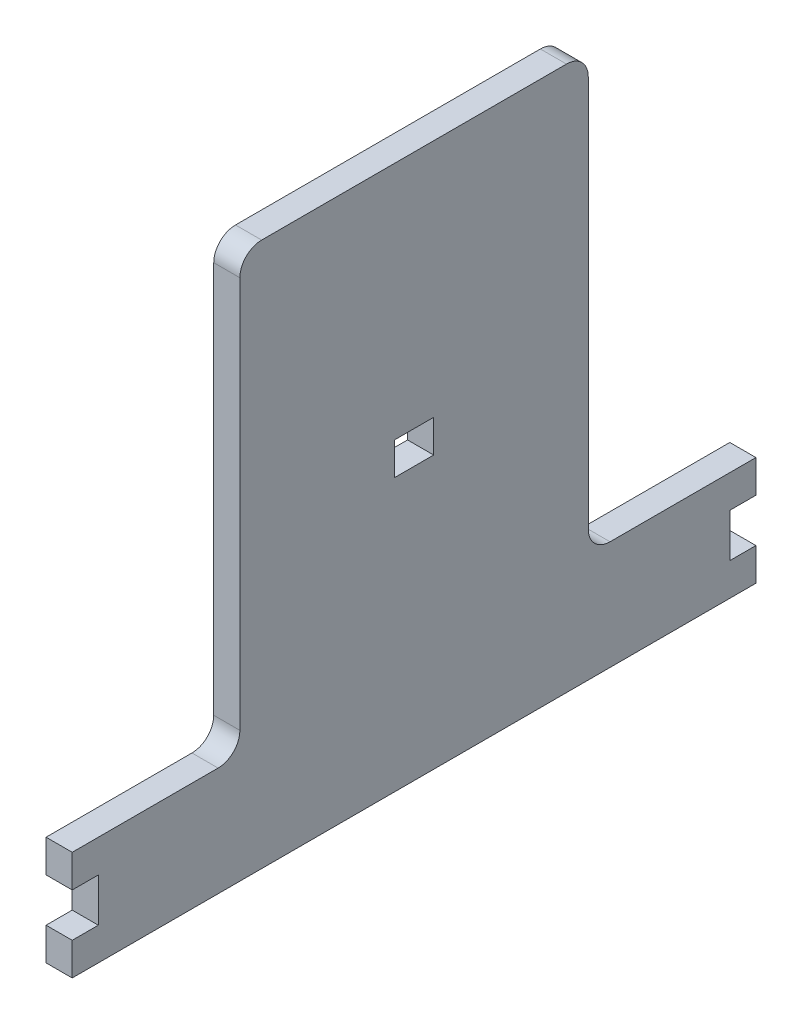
ISO-10303-21;
HEADER;
FILE_DESCRIPTION(('STEP AP214'),'2;1');
FILE_NAME('part.step','',(''),(''),'','','');
FILE_SCHEMA(('AUTOMOTIVE_DESIGN { 1 0 10303 214 1 1 1 1 }'));
ENDSEC;
DATA;
#1=APPLICATION_CONTEXT('core data for automotive mechanical design processes');
#2=APPLICATION_PROTOCOL_DEFINITION('international standard','automotive_design',2000,#1);
#3=PRODUCT_CONTEXT('',#1,'mechanical');
#4=PRODUCT('Part','Part','',(#3));
#5=PRODUCT_RELATED_PRODUCT_CATEGORY('part','',(#4));
#6=PRODUCT_DEFINITION_FORMATION('','',#4);
#7=PRODUCT_DEFINITION_CONTEXT('part definition',#1,'design');
#8=PRODUCT_DEFINITION('design','',#6,#7);
#9=PRODUCT_DEFINITION_SHAPE('','',#8);
#10=(LENGTH_UNIT() NAMED_UNIT(*) SI_UNIT(.MILLI.,.METRE.));
#11=(NAMED_UNIT(*) PLANE_ANGLE_UNIT() SI_UNIT($,.RADIAN.));
#12=(NAMED_UNIT(*) SI_UNIT($,.STERADIAN.) SOLID_ANGLE_UNIT());
#13=UNCERTAINTY_MEASURE_WITH_UNIT(LENGTH_MEASURE(1.E-05),#10,'distance_accuracy_value','');
#14=(GEOMETRIC_REPRESENTATION_CONTEXT(3) GLOBAL_UNCERTAINTY_ASSIGNED_CONTEXT((#13)) GLOBAL_UNIT_ASSIGNED_CONTEXT((#10,
#11,#12)) REPRESENTATION_CONTEXT('',''));
#15=CARTESIAN_POINT('',(0.,0.,0.));
#16=DIRECTION('',(0.,0.,1.));
#17=DIRECTION('',(1.,0.,0.));
#18=AXIS2_PLACEMENT_3D('',#15,#16,#17);
#19=CARTESIAN_POINT('',(-12.,25.,157.));
#20=DIRECTION('',(0.,1.,0.));
#21=DIRECTION('',(0.,0.,1.));
#22=AXIS2_PLACEMENT_3D('',#19,#20,#21);
#23=PLANE('',#22);
#24=DIRECTION('',(0.,0.,1.));
#25=VECTOR('',#24,1.);
#26=CARTESIAN_POINT('',(0.,25.,157.));
#27=LINE('',#26,#25);
#28=CARTESIAN_POINT('',(0.,25.,90.));
#29=VERTEX_POINT('',#28);
#30=CARTESIAN_POINT('',(0.,25.,157.));
#31=VERTEX_POINT('',#30);
#32=EDGE_CURVE('E234',#29,#31,#27,.T.);
#33=ORIENTED_EDGE('',*,*,#32,.F.);
#34=DIRECTION('',(1.,0.,0.));
#35=VECTOR('',#34,1.);
#36=CARTESIAN_POINT('',(-12.,25.,90.));
#37=LINE('',#36,#35);
#38=CARTESIAN_POINT('',(-12.,25.,90.));
#39=VERTEX_POINT('',#38);
#40=EDGE_CURVE('E372',#29,#39,#37,.F.);
#41=ORIENTED_EDGE('',*,*,#40,.T.);
#42=DIRECTION('',(0.,0.,1.));
#43=VECTOR('',#42,1.);
#44=CARTESIAN_POINT('',(-12.,25.,157.));
#45=LINE('',#44,#43);
#46=CARTESIAN_POINT('',(-12.,25.,157.));
#47=VERTEX_POINT('',#46);
#48=EDGE_CURVE('E243',#39,#47,#45,.T.);
#49=ORIENTED_EDGE('',*,*,#48,.T.);
#50=DIRECTION('',(1.,0.,0.));
#51=VECTOR('',#50,1.);
#52=CARTESIAN_POINT('',(-12.,25.,157.));
#53=LINE('',#52,#51);
#54=EDGE_CURVE('E290',#47,#31,#53,.T.);
#55=ORIENTED_EDGE('',*,*,#54,.T.);
#56=EDGE_LOOP('',(#33,#41,#49,#55));
#57=FACE_BOUND('',#56,.T.);
#58=ADVANCED_FACE('F33',(#57),#23,.T.);
#59=CARTESIAN_POINT('',(-12.,25.,80.));
#60=DIRECTION('',(0.,0.,1.));
#61=DIRECTION('',(1.,0.,0.));
#62=AXIS2_PLACEMENT_3D('',#59,#60,#61);
#63=PLANE('',#62);
#64=DIRECTION('',(0.,-1.,0.));
#65=VECTOR('',#64,1.);
#66=CARTESIAN_POINT('',(-12.,25.,80.));
#67=LINE('',#66,#65);
#68=CARTESIAN_POINT('',(-12.,215.,80.));
#69=VERTEX_POINT('',#68);
#70=CARTESIAN_POINT('',(-12.,35.,80.));
#71=VERTEX_POINT('',#70);
#72=EDGE_CURVE('E287',#69,#71,#67,.T.);
#73=ORIENTED_EDGE('',*,*,#72,.T.);
#74=DIRECTION('',(1.,0.,0.));
#75=VECTOR('',#74,1.);
#76=CARTESIAN_POINT('',(0.,35.,80.));
#77=LINE('',#76,#75);
#78=CARTESIAN_POINT('',(0.,35.,80.));
#79=VERTEX_POINT('',#78);
#80=EDGE_CURVE('E369',#71,#79,#77,.T.);
#81=ORIENTED_EDGE('',*,*,#80,.T.);
#82=DIRECTION('',(0.,-1.,0.));
#83=VECTOR('',#82,1.);
#84=CARTESIAN_POINT('',(0.,25.,80.));
#85=LINE('',#84,#83);
#86=CARTESIAN_POINT('',(0.,215.,80.));
#87=VERTEX_POINT('',#86);
#88=EDGE_CURVE('E246',#87,#79,#85,.T.);
#89=ORIENTED_EDGE('',*,*,#88,.F.);
#90=DIRECTION('',(1.,0.,0.));
#91=VECTOR('',#90,1.);
#92=CARTESIAN_POINT('',(-12.,215.,80.));
#93=LINE('',#92,#91);
#94=EDGE_CURVE('E367',#87,#69,#93,.F.);
#95=ORIENTED_EDGE('',*,*,#94,.T.);
#96=EDGE_LOOP('',(#73,#81,#89,#95));
#97=FACE_BOUND('',#96,.T.);
#98=ADVANCED_FACE('F466',(#97),#63,.T.);
#99=CARTESIAN_POINT('',(-12.,225.,80.));
#100=DIRECTION('',(0.,1.,0.));
#101=DIRECTION('',(0.,0.,1.));
#102=AXIS2_PLACEMENT_3D('',#99,#100,#101);
#103=PLANE('',#102);
#104=DIRECTION('',(0.,0.,1.));
#105=VECTOR('',#104,1.);
#106=CARTESIAN_POINT('',(-12.,225.,80.));
#107=LINE('',#106,#105);
#108=CARTESIAN_POINT('',(-12.,225.,-70.));
#109=VERTEX_POINT('',#108);
#110=CARTESIAN_POINT('',(-12.,225.,70.));
#111=VERTEX_POINT('',#110);
#112=EDGE_CURVE('E285',#109,#111,#107,.T.);
#113=ORIENTED_EDGE('',*,*,#112,.T.);
#114=DIRECTION('',(1.,0.,0.));
#115=VECTOR('',#114,1.);
#116=CARTESIAN_POINT('',(-12.,225.,70.));
#117=LINE('',#116,#115);
#118=CARTESIAN_POINT('',(0.,225.,70.));
#119=VERTEX_POINT('',#118);
#120=EDGE_CURVE('E383',#111,#119,#117,.T.);
#121=ORIENTED_EDGE('',*,*,#120,.T.);
#122=DIRECTION('',(0.,0.,1.));
#123=VECTOR('',#122,1.);
#124=CARTESIAN_POINT('',(0.,225.,80.));
#125=LINE('',#124,#123);
#126=CARTESIAN_POINT('',(0.,225.,-70.));
#127=VERTEX_POINT('',#126);
#128=EDGE_CURVE('E331',#127,#119,#125,.T.);
#129=ORIENTED_EDGE('',*,*,#128,.F.);
#130=DIRECTION('',(1.,0.,0.));
#131=VECTOR('',#130,1.);
#132=CARTESIAN_POINT('',(-12.,225.,-70.));
#133=LINE('',#132,#131);
#134=EDGE_CURVE('E55',#127,#109,#133,.F.);
#135=ORIENTED_EDGE('',*,*,#134,.T.);
#136=EDGE_LOOP('',(#113,#121,#129,#135));
#137=FACE_BOUND('',#136,.T.);
#138=ADVANCED_FACE('F472',(#137),#103,.T.);
#139=CARTESIAN_POINT('',(-12.,25.,-80.));
#140=DIRECTION('',(0.,0.,-1.));
#141=DIRECTION('',(-1.,0.,0.));
#142=AXIS2_PLACEMENT_3D('',#139,#140,#141);
#143=PLANE('',#142);
#144=DIRECTION('',(0.,1.,0.));
#145=VECTOR('',#144,1.);
#146=CARTESIAN_POINT('',(0.,25.,-80.));
#147=LINE('',#146,#145);
#148=CARTESIAN_POINT('',(0.,35.,-80.));
#149=VERTEX_POINT('',#148);
#150=CARTESIAN_POINT('',(0.,215.,-80.));
#151=VERTEX_POINT('',#150);
#152=EDGE_CURVE('E328',#149,#151,#147,.T.);
#153=ORIENTED_EDGE('',*,*,#152,.F.);
#154=DIRECTION('',(1.,0.,0.));
#155=VECTOR('',#154,1.);
#156=CARTESIAN_POINT('',(-12.,35.,-80.));
#157=LINE('',#156,#155);
#158=CARTESIAN_POINT('',(-12.,35.,-80.));
#159=VERTEX_POINT('',#158);
#160=EDGE_CURVE('E380',#149,#159,#157,.F.);
#161=ORIENTED_EDGE('',*,*,#160,.T.);
#162=DIRECTION('',(0.,1.,0.));
#163=VECTOR('',#162,1.);
#164=CARTESIAN_POINT('',(-12.,25.,-80.));
#165=LINE('',#164,#163);
#166=CARTESIAN_POINT('',(-12.,215.,-80.));
#167=VERTEX_POINT('',#166);
#168=EDGE_CURVE('E282',#159,#167,#165,.T.);
#169=ORIENTED_EDGE('',*,*,#168,.T.);
#170=DIRECTION('',(1.,0.,0.));
#171=VECTOR('',#170,1.);
#172=CARTESIAN_POINT('',(-12.,215.,-80.));
#173=LINE('',#172,#171);
#174=EDGE_CURVE('E377',#167,#151,#173,.T.);
#175=ORIENTED_EDGE('',*,*,#174,.T.);
#176=EDGE_LOOP('',(#153,#161,#169,#175));
#177=FACE_BOUND('',#176,.T.);
#178=ADVANCED_FACE('F404',(#177),#143,.T.);
#179=CARTESIAN_POINT('',(-12.,25.,-80.));
#180=DIRECTION('',(0.,1.,0.));
#181=DIRECTION('',(0.,0.,1.));
#182=AXIS2_PLACEMENT_3D('',#179,#180,#181);
#183=PLANE('',#182);
#184=DIRECTION('',(0.,0.,1.));
#185=VECTOR('',#184,1.);
#186=CARTESIAN_POINT('',(-12.,25.,-80.));
#187=LINE('',#186,#185);
#188=CARTESIAN_POINT('',(-12.,25.,-157.));
#189=VERTEX_POINT('',#188);
#190=CARTESIAN_POINT('',(-12.,25.,-90.));
#191=VERTEX_POINT('',#190);
#192=EDGE_CURVE('E279',#189,#191,#187,.T.);
#193=ORIENTED_EDGE('',*,*,#192,.T.);
#194=DIRECTION('',(1.,0.,0.));
#195=VECTOR('',#194,1.);
#196=CARTESIAN_POINT('',(0.,25.,-90.));
#197=LINE('',#196,#195);
#198=CARTESIAN_POINT('',(0.,25.,-90.));
#199=VERTEX_POINT('',#198);
#200=EDGE_CURVE('E374',#191,#199,#197,.T.);
#201=ORIENTED_EDGE('',*,*,#200,.T.);
#202=DIRECTION('',(0.,0.,1.));
#203=VECTOR('',#202,1.);
#204=CARTESIAN_POINT('',(0.,25.,-80.));
#205=LINE('',#204,#203);
#206=CARTESIAN_POINT('',(0.,25.,-157.));
#207=VERTEX_POINT('',#206);
#208=EDGE_CURVE('E325',#207,#199,#205,.T.);
#209=ORIENTED_EDGE('',*,*,#208,.F.);
#210=DIRECTION('',(1.,0.,0.));
#211=VECTOR('',#210,1.);
#212=CARTESIAN_POINT('',(-12.,25.,-157.));
#213=LINE('',#212,#211);
#214=EDGE_CURVE('E336',#189,#207,#213,.T.);
#215=ORIENTED_EDGE('',*,*,#214,.F.);
#216=EDGE_LOOP('',(#193,#201,#209,#215));
#217=FACE_BOUND('',#216,.T.);
#218=ADVANCED_FACE('F412',(#217),#183,.T.);
#219=CARTESIAN_POINT('',(-12.,25.,-157.));
#220=DIRECTION('',(0.,0.,-1.));
#221=DIRECTION('',(-1.,0.,0.));
#222=AXIS2_PLACEMENT_3D('',#219,#220,#221);
#223=PLANE('',#222);
#224=DIRECTION('',(0.,1.,0.));
#225=VECTOR('',#224,1.);
#226=CARTESIAN_POINT('',(0.,25.,-157.));
#227=LINE('',#226,#225);
#228=CARTESIAN_POINT('',(0.,10.,-157.));
#229=VERTEX_POINT('',#228);
#230=EDGE_CURVE('E322',#229,#207,#227,.T.);
#231=ORIENTED_EDGE('',*,*,#230,.F.);
#232=DIRECTION('',(1.,0.,0.));
#233=VECTOR('',#232,1.);
#234=CARTESIAN_POINT('',(-12.,10.,-157.));
#235=LINE('',#234,#233);
#236=CARTESIAN_POINT('',(-12.,10.,-157.));
#237=VERTEX_POINT('',#236);
#238=EDGE_CURVE('E339',#237,#229,#235,.T.);
#239=ORIENTED_EDGE('',*,*,#238,.F.);
#240=DIRECTION('',(0.,1.,0.));
#241=VECTOR('',#240,1.);
#242=CARTESIAN_POINT('',(-12.,25.,-157.));
#243=LINE('',#242,#241);
#244=EDGE_CURVE('E276',#237,#189,#243,.T.);
#245=ORIENTED_EDGE('',*,*,#244,.T.);
#246=ORIENTED_EDGE('',*,*,#214,.T.);
#247=EDGE_LOOP('',(#231,#239,#245,#246));
#248=FACE_BOUND('',#247,.T.);
#249=ADVANCED_FACE('F415',(#248),#223,.T.);
#250=CARTESIAN_POINT('',(-12.,10.,-157.));
#251=DIRECTION('',(0.,-1.,0.));
#252=DIRECTION('',(0.,0.,-1.));
#253=AXIS2_PLACEMENT_3D('',#250,#251,#252);
#254=PLANE('',#253);
#255=DIRECTION('',(0.,0.,-1.));
#256=VECTOR('',#255,1.);
#257=CARTESIAN_POINT('',(0.,10.,-157.));
#258=LINE('',#257,#256);
#259=CARTESIAN_POINT('',(0.,10.,-145.));
#260=VERTEX_POINT('',#259);
#261=EDGE_CURVE('E319',#260,#229,#258,.T.);
#262=ORIENTED_EDGE('',*,*,#261,.F.);
#263=DIRECTION('',(1.,0.,0.));
#264=VECTOR('',#263,1.);
#265=CARTESIAN_POINT('',(-12.,10.,-145.));
#266=LINE('',#265,#264);
#267=CARTESIAN_POINT('',(-12.,10.,-145.));
#268=VERTEX_POINT('',#267);
#269=EDGE_CURVE('E341',#268,#260,#266,.T.);
#270=ORIENTED_EDGE('',*,*,#269,.F.);
#271=DIRECTION('',(0.,0.,-1.));
#272=VECTOR('',#271,1.);
#273=CARTESIAN_POINT('',(-12.,10.,-157.));
#274=LINE('',#273,#272);
#275=EDGE_CURVE('E273',#268,#237,#274,.T.);
#276=ORIENTED_EDGE('',*,*,#275,.T.);
#277=ORIENTED_EDGE('',*,*,#238,.T.);
#278=EDGE_LOOP('',(#262,#270,#276,#277));
#279=FACE_BOUND('',#278,.T.);
#280=ADVANCED_FACE('F420',(#279),#254,.T.);
#281=CARTESIAN_POINT('',(-12.,10.,-145.));
#282=DIRECTION('',(0.,0.,-1.));
#283=DIRECTION('',(0.,1.,0.));
#284=AXIS2_PLACEMENT_3D('',#281,#282,#283);
#285=PLANE('',#284);
#286=DIRECTION('',(0.,1.,0.));
#287=VECTOR('',#286,1.);
#288=CARTESIAN_POINT('',(0.,10.,-145.));
#289=LINE('',#288,#287);
#290=CARTESIAN_POINT('',(0.,-10.,-145.));
#291=VERTEX_POINT('',#290);
#292=EDGE_CURVE('E316',#291,#260,#289,.T.);
#293=ORIENTED_EDGE('',*,*,#292,.F.);
#294=DIRECTION('',(1.,0.,0.));
#295=VECTOR('',#294,1.);
#296=CARTESIAN_POINT('',(-12.,-10.,-145.));
#297=LINE('',#296,#295);
#298=CARTESIAN_POINT('',(-12.,-10.,-145.));
#299=VERTEX_POINT('',#298);
#300=EDGE_CURVE('E343',#299,#291,#297,.T.);
#301=ORIENTED_EDGE('',*,*,#300,.F.);
#302=DIRECTION('',(0.,1.,0.));
#303=VECTOR('',#302,1.);
#304=CARTESIAN_POINT('',(-12.,10.,-145.));
#305=LINE('',#304,#303);
#306=EDGE_CURVE('E270',#299,#268,#305,.T.);
#307=ORIENTED_EDGE('',*,*,#306,.T.);
#308=ORIENTED_EDGE('',*,*,#269,.T.);
#309=EDGE_LOOP('',(#293,#301,#307,#308));
#310=FACE_BOUND('',#309,.T.);
#311=ADVANCED_FACE('F423',(#310),#285,.T.);
#312=CARTESIAN_POINT('',(-12.,-10.,-145.));
#313=DIRECTION('',(0.,1.,0.));
#314=DIRECTION('',(0.,0.,1.));
#315=AXIS2_PLACEMENT_3D('',#312,#313,#314);
#316=PLANE('',#315);
#317=DIRECTION('',(0.,0.,1.));
#318=VECTOR('',#317,1.);
#319=CARTESIAN_POINT('',(0.,-10.,-145.));
#320=LINE('',#319,#318);
#321=CARTESIAN_POINT('',(0.,-10.,-157.));
#322=VERTEX_POINT('',#321);
#323=EDGE_CURVE('E313',#322,#291,#320,.T.);
#324=ORIENTED_EDGE('',*,*,#323,.F.);
#325=DIRECTION('',(1.,0.,0.));
#326=VECTOR('',#325,1.);
#327=CARTESIAN_POINT('',(-12.,-10.,-157.));
#328=LINE('',#327,#326);
#329=CARTESIAN_POINT('',(-12.,-10.,-157.));
#330=VERTEX_POINT('',#329);
#331=EDGE_CURVE('E345',#330,#322,#328,.T.);
#332=ORIENTED_EDGE('',*,*,#331,.F.);
#333=DIRECTION('',(0.,0.,1.));
#334=VECTOR('',#333,1.);
#335=CARTESIAN_POINT('',(-12.,-10.,-145.));
#336=LINE('',#335,#334);
#337=EDGE_CURVE('E267',#330,#299,#336,.T.);
#338=ORIENTED_EDGE('',*,*,#337,.T.);
#339=ORIENTED_EDGE('',*,*,#300,.T.);
#340=EDGE_LOOP('',(#324,#332,#338,#339));
#341=FACE_BOUND('',#340,.T.);
#342=ADVANCED_FACE('F428',(#341),#316,.T.);
#343=CARTESIAN_POINT('',(-12.,-10.,-157.));
#344=DIRECTION('',(0.,0.,-1.));
#345=DIRECTION('',(-1.,0.,0.));
#346=AXIS2_PLACEMENT_3D('',#343,#344,#345);
#347=PLANE('',#346);
#348=DIRECTION('',(0.,1.,0.));
#349=VECTOR('',#348,1.);
#350=CARTESIAN_POINT('',(0.,-10.,-157.));
#351=LINE('',#350,#349);
#352=CARTESIAN_POINT('',(0.,-25.,-157.));
#353=VERTEX_POINT('',#352);
#354=EDGE_CURVE('E310',#353,#322,#351,.T.);
#355=ORIENTED_EDGE('',*,*,#354,.F.);
#356=DIRECTION('',(1.,0.,0.));
#357=VECTOR('',#356,1.);
#358=CARTESIAN_POINT('',(-12.,-25.,-157.));
#359=LINE('',#358,#357);
#360=CARTESIAN_POINT('',(-12.,-25.,-157.));
#361=VERTEX_POINT('',#360);
#362=EDGE_CURVE('E347',#361,#353,#359,.T.);
#363=ORIENTED_EDGE('',*,*,#362,.F.);
#364=DIRECTION('',(0.,1.,0.));
#365=VECTOR('',#364,1.);
#366=CARTESIAN_POINT('',(-12.,-10.,-157.));
#367=LINE('',#366,#365);
#368=EDGE_CURVE('E264',#361,#330,#367,.T.);
#369=ORIENTED_EDGE('',*,*,#368,.T.);
#370=ORIENTED_EDGE('',*,*,#331,.T.);
#371=EDGE_LOOP('',(#355,#363,#369,#370));
#372=FACE_BOUND('',#371,.T.);
#373=ADVANCED_FACE('F431',(#372),#347,.T.);
#374=CARTESIAN_POINT('',(-12.,-25.,157.));
#375=DIRECTION('',(0.,-1.,0.));
#376=DIRECTION('',(0.,0.,-1.));
#377=AXIS2_PLACEMENT_3D('',#374,#375,#376);
#378=PLANE('',#377);
#379=DIRECTION('',(0.,0.,-1.));
#380=VECTOR('',#379,1.);
#381=CARTESIAN_POINT('',(0.,-25.,157.));
#382=LINE('',#381,#380);
#383=CARTESIAN_POINT('',(0.,-25.,157.));
#384=VERTEX_POINT('',#383);
#385=EDGE_CURVE('E307',#384,#353,#382,.T.);
#386=ORIENTED_EDGE('',*,*,#385,.F.);
#387=DIRECTION('',(1.,0.,0.));
#388=VECTOR('',#387,1.);
#389=CARTESIAN_POINT('',(-12.,-25.,157.));
#390=LINE('',#389,#388);
#391=CARTESIAN_POINT('',(-12.,-25.,157.));
#392=VERTEX_POINT('',#391);
#393=EDGE_CURVE('E349',#392,#384,#390,.T.);
#394=ORIENTED_EDGE('',*,*,#393,.F.);
#395=DIRECTION('',(0.,0.,-1.));
#396=VECTOR('',#395,1.);
#397=CARTESIAN_POINT('',(-12.,-25.,157.));
#398=LINE('',#397,#396);
#399=EDGE_CURVE('E261',#392,#361,#398,.T.);
#400=ORIENTED_EDGE('',*,*,#399,.T.);
#401=ORIENTED_EDGE('',*,*,#362,.T.);
#402=EDGE_LOOP('',(#386,#394,#400,#401));
#403=FACE_BOUND('',#402,.T.);
#404=ADVANCED_FACE('F436',(#403),#378,.T.);
#405=CARTESIAN_POINT('',(-12.,-10.,157.));
#406=DIRECTION('',(0.,0.,1.));
#407=DIRECTION('',(1.,0.,0.));
#408=AXIS2_PLACEMENT_3D('',#405,#406,#407);
#409=PLANE('',#408);
#410=DIRECTION('',(0.,-1.,0.));
#411=VECTOR('',#410,1.);
#412=CARTESIAN_POINT('',(0.,-10.,157.));
#413=LINE('',#412,#411);
#414=CARTESIAN_POINT('',(0.,-10.,157.));
#415=VERTEX_POINT('',#414);
#416=EDGE_CURVE('E304',#415,#384,#413,.T.);
#417=ORIENTED_EDGE('',*,*,#416,.F.);
#418=DIRECTION('',(1.,0.,0.));
#419=VECTOR('',#418,1.);
#420=CARTESIAN_POINT('',(-12.,-10.,157.));
#421=LINE('',#420,#419);
#422=CARTESIAN_POINT('',(-12.,-10.,157.));
#423=VERTEX_POINT('',#422);
#424=EDGE_CURVE('E351',#423,#415,#421,.T.);
#425=ORIENTED_EDGE('',*,*,#424,.F.);
#426=DIRECTION('',(0.,-1.,0.));
#427=VECTOR('',#426,1.);
#428=CARTESIAN_POINT('',(-12.,-10.,157.));
#429=LINE('',#428,#427);
#430=EDGE_CURVE('E258',#423,#392,#429,.T.);
#431=ORIENTED_EDGE('',*,*,#430,.T.);
#432=ORIENTED_EDGE('',*,*,#393,.T.);
#433=EDGE_LOOP('',(#417,#425,#431,#432));
#434=FACE_BOUND('',#433,.T.);
#435=ADVANCED_FACE('F439',(#434),#409,.T.);
#436=CARTESIAN_POINT('',(-12.,-10.,145.));
#437=DIRECTION('',(0.,1.,0.));
#438=DIRECTION('',(0.,0.,1.));
#439=AXIS2_PLACEMENT_3D('',#436,#437,#438);
#440=PLANE('',#439);
#441=DIRECTION('',(0.,0.,1.));
#442=VECTOR('',#441,1.);
#443=CARTESIAN_POINT('',(0.,-10.,145.));
#444=LINE('',#443,#442);
#445=CARTESIAN_POINT('',(0.,-10.,145.));
#446=VERTEX_POINT('',#445);
#447=EDGE_CURVE('E301',#446,#415,#444,.T.);
#448=ORIENTED_EDGE('',*,*,#447,.F.);
#449=DIRECTION('',(1.,0.,0.));
#450=VECTOR('',#449,1.);
#451=CARTESIAN_POINT('',(-12.,-10.,145.));
#452=LINE('',#451,#450);
#453=CARTESIAN_POINT('',(-12.,-10.,145.));
#454=VERTEX_POINT('',#453);
#455=EDGE_CURVE('E353',#454,#446,#452,.T.);
#456=ORIENTED_EDGE('',*,*,#455,.F.);
#457=DIRECTION('',(0.,0.,1.));
#458=VECTOR('',#457,1.);
#459=CARTESIAN_POINT('',(-12.,-10.,145.));
#460=LINE('',#459,#458);
#461=EDGE_CURVE('E255',#454,#423,#460,.T.);
#462=ORIENTED_EDGE('',*,*,#461,.T.);
#463=ORIENTED_EDGE('',*,*,#424,.T.);
#464=EDGE_LOOP('',(#448,#456,#462,#463));
#465=FACE_BOUND('',#464,.T.);
#466=ADVANCED_FACE('F444',(#465),#440,.T.);
#467=CARTESIAN_POINT('',(-12.,10.,145.));
#468=DIRECTION('',(0.,0.,1.));
#469=DIRECTION('',(0.,-1.,0.));
#470=AXIS2_PLACEMENT_3D('',#467,#468,#469);
#471=PLANE('',#470);
#472=DIRECTION('',(0.,-1.,0.));
#473=VECTOR('',#472,1.);
#474=CARTESIAN_POINT('',(0.,10.,145.));
#475=LINE('',#474,#473);
#476=CARTESIAN_POINT('',(0.,10.,145.));
#477=VERTEX_POINT('',#476);
#478=EDGE_CURVE('E298',#477,#446,#475,.T.);
#479=ORIENTED_EDGE('',*,*,#478,.F.);
#480=DIRECTION('',(1.,0.,0.));
#481=VECTOR('',#480,1.);
#482=CARTESIAN_POINT('',(-12.,10.,145.));
#483=LINE('',#482,#481);
#484=CARTESIAN_POINT('',(-12.,10.,145.));
#485=VERTEX_POINT('',#484);
#486=EDGE_CURVE('E355',#485,#477,#483,.T.);
#487=ORIENTED_EDGE('',*,*,#486,.F.);
#488=DIRECTION('',(0.,-1.,0.));
#489=VECTOR('',#488,1.);
#490=CARTESIAN_POINT('',(-12.,10.,145.));
#491=LINE('',#490,#489);
#492=EDGE_CURVE('E252',#485,#454,#491,.T.);
#493=ORIENTED_EDGE('',*,*,#492,.T.);
#494=ORIENTED_EDGE('',*,*,#455,.T.);
#495=EDGE_LOOP('',(#479,#487,#493,#494));
#496=FACE_BOUND('',#495,.T.);
#497=ADVANCED_FACE('F447',(#496),#471,.T.);
#498=CARTESIAN_POINT('',(-12.,10.,157.));
#499=DIRECTION('',(0.,-1.,0.));
#500=DIRECTION('',(0.,0.,-1.));
#501=AXIS2_PLACEMENT_3D('',#498,#499,#500);
#502=PLANE('',#501);
#503=DIRECTION('',(0.,0.,-1.));
#504=VECTOR('',#503,1.);
#505=CARTESIAN_POINT('',(0.,10.,157.));
#506=LINE('',#505,#504);
#507=CARTESIAN_POINT('',(0.,10.,157.));
#508=VERTEX_POINT('',#507);
#509=EDGE_CURVE('E295',#508,#477,#506,.T.);
#510=ORIENTED_EDGE('',*,*,#509,.F.);
#511=DIRECTION('',(1.,0.,0.));
#512=VECTOR('',#511,1.);
#513=CARTESIAN_POINT('',(-12.,10.,157.));
#514=LINE('',#513,#512);
#515=CARTESIAN_POINT('',(-12.,10.,157.));
#516=VERTEX_POINT('',#515);
#517=EDGE_CURVE('E357',#516,#508,#514,.T.);
#518=ORIENTED_EDGE('',*,*,#517,.F.);
#519=DIRECTION('',(0.,0.,-1.));
#520=VECTOR('',#519,1.);
#521=CARTESIAN_POINT('',(-12.,10.,157.));
#522=LINE('',#521,#520);
#523=EDGE_CURVE('E249',#516,#485,#522,.T.);
#524=ORIENTED_EDGE('',*,*,#523,.T.);
#525=ORIENTED_EDGE('',*,*,#486,.T.);
#526=EDGE_LOOP('',(#510,#518,#524,#525));
#527=FACE_BOUND('',#526,.T.);
#528=ADVANCED_FACE('F452',(#527),#502,.T.);
#529=CARTESIAN_POINT('',(-12.,25.,157.));
#530=DIRECTION('',(0.,0.,1.));
#531=DIRECTION('',(1.,0.,0.));
#532=AXIS2_PLACEMENT_3D('',#529,#530,#531);
#533=PLANE('',#532);
#534=DIRECTION('',(0.,-1.,0.));
#535=VECTOR('',#534,1.);
#536=CARTESIAN_POINT('',(0.,25.,157.));
#537=LINE('',#536,#535);
#538=EDGE_CURVE('E292',#31,#508,#537,.T.);
#539=ORIENTED_EDGE('',*,*,#538,.F.);
#540=ORIENTED_EDGE('',*,*,#54,.F.);
#541=DIRECTION('',(0.,-1.,0.));
#542=VECTOR('',#541,1.);
#543=CARTESIAN_POINT('',(-12.,25.,157.));
#544=LINE('',#543,#542);
#545=EDGE_CURVE('E245',#47,#516,#544,.T.);
#546=ORIENTED_EDGE('',*,*,#545,.T.);
#547=ORIENTED_EDGE('',*,*,#517,.T.);
#548=EDGE_LOOP('',(#539,#540,#546,#547));
#549=FACE_BOUND('',#548,.T.);
#550=ADVANCED_FACE('F455',(#549),#533,.T.);
#551=CARTESIAN_POINT('',(-12.,0.,0.));
#552=DIRECTION('',(1.,0.,0.));
#553=DIRECTION('',(0.,0.,-1.));
#554=AXIS2_PLACEMENT_3D('',#551,#552,#553);
#555=PLANE('',#554);
#556=DIRECTION('',(0.,0.,1.));
#557=VECTOR('',#556,1.);
#558=CARTESIAN_POINT('',(-12.,100.,-9.));
#559=LINE('',#558,#557);
#560=CARTESIAN_POINT('',(-12.,100.,-9.));
#561=VERTEX_POINT('',#560);
#562=CARTESIAN_POINT('',(-12.,100.,9.));
#563=VERTEX_POINT('',#562);
#564=EDGE_CURVE('E211',#561,#563,#559,.T.);
#565=ORIENTED_EDGE('',*,*,#564,.F.);
#566=DIRECTION('',(0.,-1.,0.));
#567=VECTOR('',#566,1.);
#568=CARTESIAN_POINT('',(-12.,115.,-9.));
#569=LINE('',#568,#567);
#570=CARTESIAN_POINT('',(-12.,115.,-9.));
#571=VERTEX_POINT('',#570);
#572=EDGE_CURVE('E216',#571,#561,#569,.T.);
#573=ORIENTED_EDGE('',*,*,#572,.F.);
#574=DIRECTION('',(0.,0.,-1.));
#575=VECTOR('',#574,1.);
#576=CARTESIAN_POINT('',(-12.,115.,-9.));
#577=LINE('',#576,#575);
#578=CARTESIAN_POINT('',(-12.,115.,9.));
#579=VERTEX_POINT('',#578);
#580=EDGE_CURVE('E221',#579,#571,#577,.T.);
#581=ORIENTED_EDGE('',*,*,#580,.F.);
#582=DIRECTION('',(0.,1.,0.));
#583=VECTOR('',#582,1.);
#584=CARTESIAN_POINT('',(-12.,115.,9.));
#585=LINE('',#584,#583);
#586=EDGE_CURVE('E200',#563,#579,#585,.T.);
#587=ORIENTED_EDGE('',*,*,#586,.F.);
#588=EDGE_LOOP('',(#565,#573,#581,#587));
#589=FACE_BOUND('',#588,.T.);
#590=CARTESIAN_POINT('',(-12.,129.7,-60.3));
#591=DIRECTION('',(-1.,0.,0.));
#592=DIRECTION('',(0.,0.,1.));
#593=AXIS2_PLACEMENT_3D('',#590,#591,#592);
#594=CIRCLE('',#593,4.70000000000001);
#595=CARTESIAN_POINT('',(-12.,129.7,-55.6));
#596=VERTEX_POINT('',#595);
#597=EDGE_CURVE('E235',#596,#596,#594,.T.);
#598=ORIENTED_EDGE('',*,*,#597,.F.);
#599=EDGE_LOOP('',(#598));
#600=FACE_BOUND('',#599,.T.);
#601=CARTESIAN_POINT('',(-12.,129.7,60.3));
#602=DIRECTION('',(-1.,0.,0.));
#603=DIRECTION('',(0.,0.,1.));
#604=AXIS2_PLACEMENT_3D('',#601,#602,#603);
#605=CIRCLE('',#604,4.70000000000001);
#606=CARTESIAN_POINT('',(-12.,129.7,65.));
#607=VERTEX_POINT('',#606);
#608=EDGE_CURVE('E228',#607,#607,#605,.T.);
#609=ORIENTED_EDGE('',*,*,#608,.F.);
#610=EDGE_LOOP('',(#609));
#611=FACE_BOUND('',#610,.T.);
#612=ORIENTED_EDGE('',*,*,#72,.F.);
#613=CARTESIAN_POINT('',(-12.,215.,70.));
#614=DIRECTION('',(1.,0.,0.));
#615=DIRECTION('',(0.,0.,-1.));
#616=AXIS2_PLACEMENT_3D('',#613,#614,#615);
#617=CIRCLE('',#616,10.);
#618=EDGE_CURVE('E48',#69,#111,#617,.F.);
#619=ORIENTED_EDGE('',*,*,#618,.T.);
#620=ORIENTED_EDGE('',*,*,#112,.F.);
#621=CARTESIAN_POINT('',(-12.,215.,-70.));
#622=DIRECTION('',(1.,0.,0.));
#623=DIRECTION('',(0.,0.,-1.));
#624=AXIS2_PLACEMENT_3D('',#621,#622,#623);
#625=CIRCLE('',#624,10.);
#626=EDGE_CURVE('E390',#109,#167,#625,.F.);
#627=ORIENTED_EDGE('',*,*,#626,.T.);
#628=ORIENTED_EDGE('',*,*,#168,.F.);
#629=CARTESIAN_POINT('',(-12.,35.,-90.));
#630=DIRECTION('',(1.,0.,0.));
#631=DIRECTION('',(0.,0.,-1.));
#632=AXIS2_PLACEMENT_3D('',#629,#630,#631);
#633=CIRCLE('',#632,10.);
#634=EDGE_CURVE('E11',#159,#191,#633,.T.);
#635=ORIENTED_EDGE('',*,*,#634,.T.);
#636=ORIENTED_EDGE('',*,*,#192,.F.);
#637=ORIENTED_EDGE('',*,*,#244,.F.);
#638=ORIENTED_EDGE('',*,*,#275,.F.);
#639=ORIENTED_EDGE('',*,*,#306,.F.);
#640=ORIENTED_EDGE('',*,*,#337,.F.);
#641=ORIENTED_EDGE('',*,*,#368,.F.);
#642=ORIENTED_EDGE('',*,*,#399,.F.);
#643=ORIENTED_EDGE('',*,*,#430,.F.);
#644=ORIENTED_EDGE('',*,*,#461,.F.);
#645=ORIENTED_EDGE('',*,*,#492,.F.);
#646=ORIENTED_EDGE('',*,*,#523,.F.);
#647=ORIENTED_EDGE('',*,*,#545,.F.);
#648=ORIENTED_EDGE('',*,*,#48,.F.);
#649=CARTESIAN_POINT('',(-12.,35.,90.));
#650=DIRECTION('',(1.,0.,0.));
#651=DIRECTION('',(0.,0.,-1.));
#652=AXIS2_PLACEMENT_3D('',#649,#650,#651);
#653=CIRCLE('',#652,10.);
#654=EDGE_CURVE('E395',#39,#71,#653,.T.);
#655=ORIENTED_EDGE('',*,*,#654,.T.);
#656=EDGE_LOOP('',(#612,#619,#620,#627,#628,#635,#636,#637,#638,#639,#640,#641,#642,#643,#644,
#645,#646,#647,#648,#655));
#657=FACE_BOUND('',#656,.T.);
#658=ADVANCED_FACE('F218',(#589,#600,#611,#657),#555,.F.);
#659=CARTESIAN_POINT('',(0.,0.,0.));
#660=DIRECTION('',(1.,0.,0.));
#661=DIRECTION('',(0.,0.,-1.));
#662=AXIS2_PLACEMENT_3D('',#659,#660,#661);
#663=PLANE('',#662);
#664=DIRECTION('',(0.,1.,0.));
#665=VECTOR('',#664,1.);
#666=CARTESIAN_POINT('',(0.,0.,-8.99999999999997));
#667=LINE('',#666,#665);
#668=CARTESIAN_POINT('',(0.,100.,-9.));
#669=VERTEX_POINT('',#668);
#670=CARTESIAN_POINT('',(0.,115.,-9.));
#671=VERTEX_POINT('',#670);
#672=EDGE_CURVE('E365',#669,#671,#667,.T.);
#673=ORIENTED_EDGE('',*,*,#672,.F.);
#674=DIRECTION('',(0.,0.,-1.));
#675=VECTOR('',#674,1.);
#676=CARTESIAN_POINT('',(0.,100.,0.));
#677=LINE('',#676,#675);
#678=CARTESIAN_POINT('',(0.,100.,9.));
#679=VERTEX_POINT('',#678);
#680=EDGE_CURVE('E338',#679,#669,#677,.T.);
#681=ORIENTED_EDGE('',*,*,#680,.F.);
#682=DIRECTION('',(0.,-1.,0.));
#683=VECTOR('',#682,1.);
#684=CARTESIAN_POINT('',(0.,0.,8.99999999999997));
#685=LINE('',#684,#683);
#686=CARTESIAN_POINT('',(0.,115.,9.));
#687=VERTEX_POINT('',#686);
#688=EDGE_CURVE('E203',#687,#679,#685,.T.);
#689=ORIENTED_EDGE('',*,*,#688,.F.);
#690=DIRECTION('',(0.,0.,1.));
#691=VECTOR('',#690,1.);
#692=CARTESIAN_POINT('',(0.,115.,0.));
#693=LINE('',#692,#691);
#694=EDGE_CURVE('E363',#671,#687,#693,.T.);
#695=ORIENTED_EDGE('',*,*,#694,.F.);
#696=EDGE_LOOP('',(#673,#681,#689,#695));
#697=FACE_BOUND('',#696,.T.);
#698=ORIENTED_EDGE('',*,*,#128,.T.);
#699=CARTESIAN_POINT('',(0.,215.,70.));
#700=DIRECTION('',(1.,0.,0.));
#701=DIRECTION('',(0.,0.,-1.));
#702=AXIS2_PLACEMENT_3D('',#699,#700,#701);
#703=CIRCLE('',#702,10.);
#704=EDGE_CURVE('E388',#119,#87,#703,.T.);
#705=ORIENTED_EDGE('',*,*,#704,.T.);
#706=ORIENTED_EDGE('',*,*,#88,.T.);
#707=CARTESIAN_POINT('',(0.,35.,90.));
#708=DIRECTION('',(1.,0.,0.));
#709=DIRECTION('',(0.,0.,-1.));
#710=AXIS2_PLACEMENT_3D('',#707,#708,#709);
#711=CIRCLE('',#710,10.);
#712=EDGE_CURVE('E393',#79,#29,#711,.F.);
#713=ORIENTED_EDGE('',*,*,#712,.T.);
#714=ORIENTED_EDGE('',*,*,#32,.T.);
#715=ORIENTED_EDGE('',*,*,#538,.T.);
#716=ORIENTED_EDGE('',*,*,#509,.T.);
#717=ORIENTED_EDGE('',*,*,#478,.T.);
#718=ORIENTED_EDGE('',*,*,#447,.T.);
#719=ORIENTED_EDGE('',*,*,#416,.T.);
#720=ORIENTED_EDGE('',*,*,#385,.T.);
#721=ORIENTED_EDGE('',*,*,#354,.T.);
#722=ORIENTED_EDGE('',*,*,#323,.T.);
#723=ORIENTED_EDGE('',*,*,#292,.T.);
#724=ORIENTED_EDGE('',*,*,#261,.T.);
#725=ORIENTED_EDGE('',*,*,#230,.T.);
#726=ORIENTED_EDGE('',*,*,#208,.T.);
#727=CARTESIAN_POINT('',(0.,35.,-90.));
#728=DIRECTION('',(1.,0.,0.));
#729=DIRECTION('',(0.,0.,-1.));
#730=AXIS2_PLACEMENT_3D('',#727,#728,#729);
#731=CIRCLE('',#730,10.);
#732=EDGE_CURVE('E41',#199,#149,#731,.F.);
#733=ORIENTED_EDGE('',*,*,#732,.T.);
#734=ORIENTED_EDGE('',*,*,#152,.T.);
#735=CARTESIAN_POINT('',(0.,215.,-70.));
#736=DIRECTION('',(1.,0.,0.));
#737=DIRECTION('',(0.,0.,-1.));
#738=AXIS2_PLACEMENT_3D('',#735,#736,#737);
#739=CIRCLE('',#738,10.);
#740=EDGE_CURVE('E386',#151,#127,#739,.T.);
#741=ORIENTED_EDGE('',*,*,#740,.T.);
#742=EDGE_LOOP('',(#698,#705,#706,#713,#714,#715,#716,#717,#718,#719,#720,#721,#722,#723,#724,
#725,#726,#733,#734,#741));
#743=FACE_BOUND('',#742,.T.);
#744=ADVANCED_FACE('F398',(#697,#743),#663,.T.);
#745=CARTESIAN_POINT('',(-7.,129.7,60.3));
#746=DIRECTION('',(-1.,0.,0.));
#747=DIRECTION('',(0.,0.,1.));
#748=AXIS2_PLACEMENT_3D('',#745,#746,#747);
#749=CYLINDRICAL_SURFACE('',#748,4.70000000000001);
#750=CARTESIAN_POINT('',(-7.,129.7,60.3));
#751=DIRECTION('',(-1.,0.,0.));
#752=DIRECTION('',(0.,0.,1.));
#753=AXIS2_PLACEMENT_3D('',#750,#751,#752);
#754=CIRCLE('',#753,4.70000000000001);
#755=CARTESIAN_POINT('',(-7.,129.7,65.));
#756=VERTEX_POINT('',#755);
#757=EDGE_CURVE('E238',#756,#756,#754,.T.);
#758=ORIENTED_EDGE('',*,*,#757,.F.);
#759=EDGE_LOOP('',(#758));
#760=FACE_BOUND('',#759,.T.);
#761=ORIENTED_EDGE('',*,*,#608,.T.);
#762=EDGE_LOOP('',(#761));
#763=FACE_BOUND('',#762,.T.);
#764=ADVANCED_FACE('F571',(#760,#763),#749,.F.);
#765=CARTESIAN_POINT('',(-7.,129.7,60.3));
#766=DIRECTION('',(-1.,0.,0.));
#767=DIRECTION('',(0.,0.,1.));
#768=AXIS2_PLACEMENT_3D('',#765,#766,#767);
#769=PLANE('',#768);
#770=ORIENTED_EDGE('',*,*,#757,.T.);
#771=EDGE_LOOP('',(#770));
#772=FACE_BOUND('',#771,.T.);
#773=ADVANCED_FACE('F562',(#772),#769,.T.);
#774=CARTESIAN_POINT('',(-7.,129.7,-60.3));
#775=DIRECTION('',(-1.,0.,0.));
#776=DIRECTION('',(0.,0.,1.));
#777=AXIS2_PLACEMENT_3D('',#774,#775,#776);
#778=CYLINDRICAL_SURFACE('',#777,4.70000000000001);
#779=CARTESIAN_POINT('',(-7.,129.7,-60.3));
#780=DIRECTION('',(-1.,0.,0.));
#781=DIRECTION('',(0.,0.,1.));
#782=AXIS2_PLACEMENT_3D('',#779,#780,#781);
#783=CIRCLE('',#782,4.70000000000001);
#784=CARTESIAN_POINT('',(-7.,129.7,-55.6));
#785=VERTEX_POINT('',#784);
#786=EDGE_CURVE('E231',#785,#785,#783,.T.);
#787=ORIENTED_EDGE('',*,*,#786,.F.);
#788=EDGE_LOOP('',(#787));
#789=FACE_BOUND('',#788,.T.);
#790=ORIENTED_EDGE('',*,*,#597,.T.);
#791=EDGE_LOOP('',(#790));
#792=FACE_BOUND('',#791,.T.);
#793=ADVANCED_FACE('F553',(#789,#792),#778,.F.);
#794=CARTESIAN_POINT('',(-7.,129.7,-60.3));
#795=DIRECTION('',(-1.,0.,0.));
#796=DIRECTION('',(0.,0.,1.));
#797=AXIS2_PLACEMENT_3D('',#794,#795,#796);
#798=PLANE('',#797);
#799=ORIENTED_EDGE('',*,*,#786,.T.);
#800=EDGE_LOOP('',(#799));
#801=FACE_BOUND('',#800,.T.);
#802=ADVANCED_FACE('F544',(#801),#798,.T.);
#803=CARTESIAN_POINT('',(3.,115.,-9.));
#804=DIRECTION('',(0.,0.,-1.));
#805=DIRECTION('',(0.,1.,0.));
#806=AXIS2_PLACEMENT_3D('',#803,#804,#805);
#807=PLANE('',#806);
#808=ORIENTED_EDGE('',*,*,#672,.T.);
#809=DIRECTION('',(-1.,0.,0.));
#810=VECTOR('',#809,1.);
#811=CARTESIAN_POINT('',(3.,115.,-9.));
#812=LINE('',#811,#810);
#813=EDGE_CURVE('E226',#671,#571,#812,.T.);
#814=ORIENTED_EDGE('',*,*,#813,.T.);
#815=ORIENTED_EDGE('',*,*,#572,.T.);
#816=DIRECTION('',(-1.,0.,0.));
#817=VECTOR('',#816,1.);
#818=CARTESIAN_POINT('',(3.,100.,-9.));
#819=LINE('',#818,#817);
#820=EDGE_CURVE('E207',#669,#561,#819,.T.);
#821=ORIENTED_EDGE('',*,*,#820,.F.);
#822=EDGE_LOOP('',(#808,#814,#815,#821));
#823=FACE_BOUND('',#822,.T.);
#824=ADVANCED_FACE('F535',(#823),#807,.F.);
#825=CARTESIAN_POINT('',(3.,115.,-9.));
#826=DIRECTION('',(0.,1.,0.));
#827=DIRECTION('',(0.,0.,1.));
#828=AXIS2_PLACEMENT_3D('',#825,#826,#827);
#829=PLANE('',#828);
#830=ORIENTED_EDGE('',*,*,#694,.T.);
#831=DIRECTION('',(-1.,0.,0.));
#832=VECTOR('',#831,1.);
#833=CARTESIAN_POINT('',(3.,115.,9.));
#834=LINE('',#833,#832);
#835=EDGE_CURVE('E206',#687,#579,#834,.T.);
#836=ORIENTED_EDGE('',*,*,#835,.T.);
#837=ORIENTED_EDGE('',*,*,#580,.T.);
#838=ORIENTED_EDGE('',*,*,#813,.F.);
#839=EDGE_LOOP('',(#830,#836,#837,#838));
#840=FACE_BOUND('',#839,.T.);
#841=ADVANCED_FACE('F527',(#840),#829,.F.);
#842=CARTESIAN_POINT('',(3.,115.,9.));
#843=DIRECTION('',(0.,0.,1.));
#844=DIRECTION('',(0.,-1.,0.));
#845=AXIS2_PLACEMENT_3D('',#842,#843,#844);
#846=PLANE('',#845);
#847=ORIENTED_EDGE('',*,*,#688,.T.);
#848=DIRECTION('',(-1.,0.,0.));
#849=VECTOR('',#848,1.);
#850=CARTESIAN_POINT('',(3.,100.,9.));
#851=LINE('',#850,#849);
#852=EDGE_CURVE('E195',#679,#563,#851,.T.);
#853=ORIENTED_EDGE('',*,*,#852,.T.);
#854=ORIENTED_EDGE('',*,*,#586,.T.);
#855=ORIENTED_EDGE('',*,*,#835,.F.);
#856=EDGE_LOOP('',(#847,#853,#854,#855));
#857=FACE_BOUND('',#856,.T.);
#858=ADVANCED_FACE('F197',(#857),#846,.F.);
#859=CARTESIAN_POINT('',(3.,100.,-9.));
#860=DIRECTION('',(0.,-1.,0.));
#861=DIRECTION('',(0.,0.,-1.));
#862=AXIS2_PLACEMENT_3D('',#859,#860,#861);
#863=PLANE('',#862);
#864=ORIENTED_EDGE('',*,*,#680,.T.);
#865=ORIENTED_EDGE('',*,*,#820,.T.);
#866=ORIENTED_EDGE('',*,*,#564,.T.);
#867=ORIENTED_EDGE('',*,*,#852,.F.);
#868=EDGE_LOOP('',(#864,#865,#866,#867));
#869=FACE_BOUND('',#868,.T.);
#870=ADVANCED_FACE('F212',(#869),#863,.F.);
#871=CARTESIAN_POINT('',(-12.,35.,90.));
#872=DIRECTION('',(-1.,0.,0.));
#873=DIRECTION('',(0.,0.,1.));
#874=AXIS2_PLACEMENT_3D('',#871,#872,#873);
#875=CYLINDRICAL_SURFACE('',#874,10.);
#876=ORIENTED_EDGE('',*,*,#654,.F.);
#877=ORIENTED_EDGE('',*,*,#40,.F.);
#878=ORIENTED_EDGE('',*,*,#712,.F.);
#879=ORIENTED_EDGE('',*,*,#80,.F.);
#880=EDGE_LOOP('',(#876,#877,#878,#879));
#881=FACE_BOUND('',#880,.T.);
#882=ADVANCED_FACE('F463',(#881),#875,.F.);
#883=CARTESIAN_POINT('',(-12.,35.,-90.));
#884=DIRECTION('',(-1.,0.,0.));
#885=DIRECTION('',(0.,0.,1.));
#886=AXIS2_PLACEMENT_3D('',#883,#884,#885);
#887=CYLINDRICAL_SURFACE('',#886,10.);
#888=ORIENTED_EDGE('',*,*,#634,.F.);
#889=ORIENTED_EDGE('',*,*,#160,.F.);
#890=ORIENTED_EDGE('',*,*,#732,.F.);
#891=ORIENTED_EDGE('',*,*,#200,.F.);
#892=EDGE_LOOP('',(#888,#889,#890,#891));
#893=FACE_BOUND('',#892,.T.);
#894=ADVANCED_FACE('F408',(#893),#887,.F.);
#895=CARTESIAN_POINT('',(-12.,215.,70.));
#896=DIRECTION('',(1.,0.,0.));
#897=DIRECTION('',(0.,0.,-1.));
#898=AXIS2_PLACEMENT_3D('',#895,#896,#897);
#899=CYLINDRICAL_SURFACE('',#898,10.);
#900=ORIENTED_EDGE('',*,*,#618,.F.);
#901=ORIENTED_EDGE('',*,*,#94,.F.);
#902=ORIENTED_EDGE('',*,*,#704,.F.);
#903=ORIENTED_EDGE('',*,*,#120,.F.);
#904=EDGE_LOOP('',(#900,#901,#902,#903));
#905=FACE_BOUND('',#904,.T.);
#906=ADVANCED_FACE('F471',(#905),#899,.T.);
#907=CARTESIAN_POINT('',(-12.,215.,-70.));
#908=DIRECTION('',(1.,0.,0.));
#909=DIRECTION('',(0.,0.,-1.));
#910=AXIS2_PLACEMENT_3D('',#907,#908,#909);
#911=CYLINDRICAL_SURFACE('',#910,10.);
#912=ORIENTED_EDGE('',*,*,#626,.F.);
#913=ORIENTED_EDGE('',*,*,#134,.F.);
#914=ORIENTED_EDGE('',*,*,#740,.F.);
#915=ORIENTED_EDGE('',*,*,#174,.F.);
#916=EDGE_LOOP('',(#912,#913,#914,#915));
#917=FACE_BOUND('',#916,.T.);
#918=ADVANCED_FACE('F35',(#917),#911,.T.);
#919=CLOSED_SHELL('',(#58,#98,#138,#178,#218,#249,#280,#311,#342,#373,#404,#435,#466,#497,#528,
#550,#658,#744,#764,#773,#793,#802,#824,#841,#858,#870,#882,#894,#906,#918));
#920=MANIFOLD_SOLID_BREP('B2',#919);
#921=ADVANCED_BREP_SHAPE_REPRESENTATION('',(#18,#920),#14);
#922=SHAPE_DEFINITION_REPRESENTATION(#9,#921);
ENDSEC;
END-ISO-10303-21;
